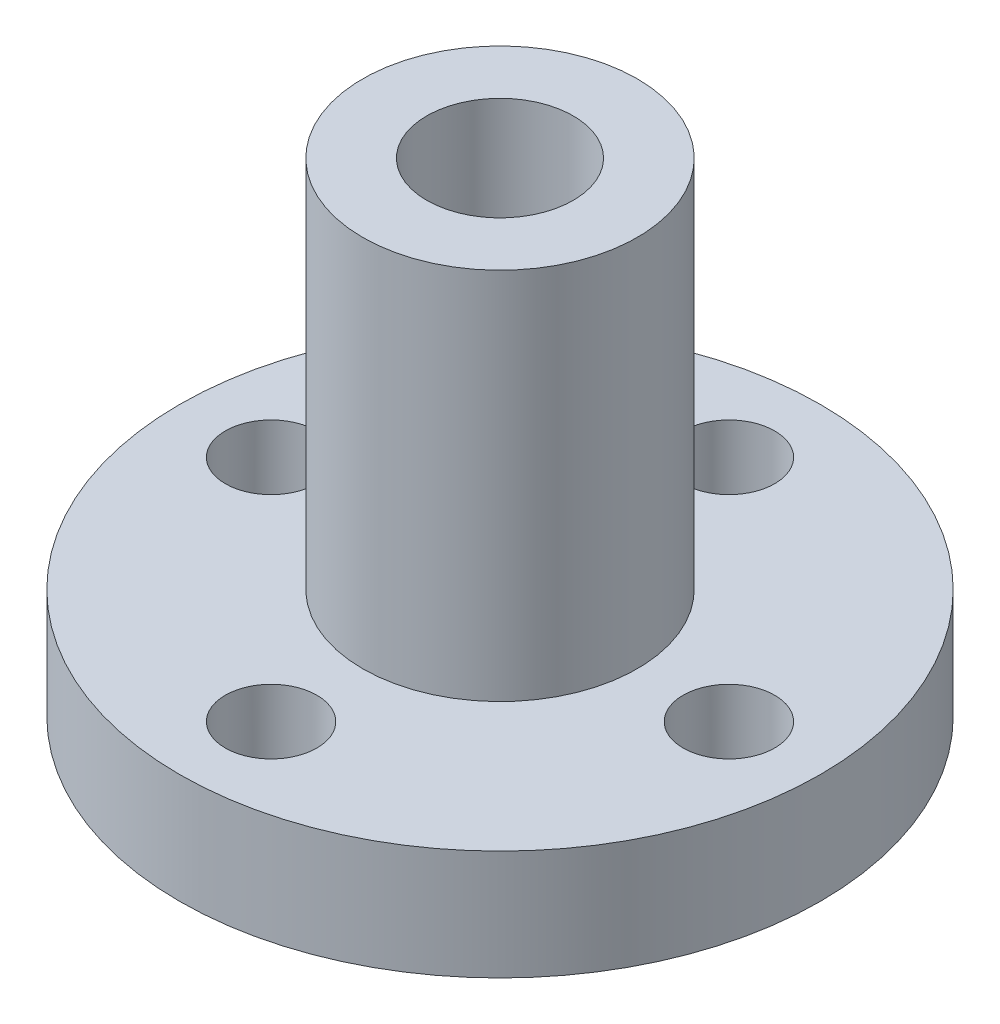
from build123d import *

# Parameters (mm, degrees)
SKETCH_1_R               = 17.5
EXTRUDE_1_DEPTH          = 6
SKETCH_3_R               = 7.5
EXTRUDE_2_DEPTH          = 20.4
SKETCH_4_R               = 4
CUT_EXTRUDE_1_DEPTH      = 37.186461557
SKETCH_5_R               = 2.5
CUT_EXTRUDE_2_DEPTH      = 10
PATTERN_CIRCULAR_1_COUNT = 4


with BuildPart() as part:
    # Sketch 1 → Extrude 1 (new body)
    with BuildSketch(Plane(origin=(0, 0, 0), x_dir=(1, 0, 0), z_dir=(0, 1, 0))):
        with Locations(Location((0, 0, 0), (0, 0, 270))):
            Circle(SKETCH_1_R)
    extrude(amount=EXTRUDE_1_DEPTH)

    # Sketch 3 → Extrude 2 (add)
    with BuildSketch(Plane(origin=(0, 6, 0), x_dir=(1, 0, 0), z_dir=(0, 1, 0))):
        with Locations(Location((0, 0, 0), (0, 0, 270))):
            Circle(SKETCH_3_R)
    extrude(amount=EXTRUDE_2_DEPTH)

    # Sketch 4 → Cut-Extrude 1 (cut, through all)
    with BuildSketch(Plane(origin=(0, 26.4, 0), x_dir=(1, 0, 0), z_dir=(0, 1, 0))):
        with Locations(Location((0, 0, 0), (0, 0, 270))):
            Circle(SKETCH_4_R)
    extrude(amount=-CUT_EXTRUDE_1_DEPTH, mode=Mode.SUBTRACT)

    # Sketch 5 → Cut-Extrude 2 (cut)
    with BuildSketch(Plane(origin=(0, 6, 0), x_dir=(1, 0, 0), z_dir=(0, 1, 0))):
        with Locations(Location((0, 12.5, 0), (0, 0, 270))):
            Circle(SKETCH_5_R)
    cut_extrude_2 = extrude(amount=-CUT_EXTRUDE_2_DEPTH, mode=Mode.SUBTRACT)

    # Pattern Circular 1: Cut-Extrude 2 ×4 about axis
    pattern_circular_1_axis = Axis((0, 0, 0), (0, 1, 0))
    for i in range(1, PATTERN_CIRCULAR_1_COUNT):
        add(cut_extrude_2.rotate(pattern_circular_1_axis, i * 360 / PATTERN_CIRCULAR_1_COUNT), mode=Mode.SUBTRACT)


solid = part.part
